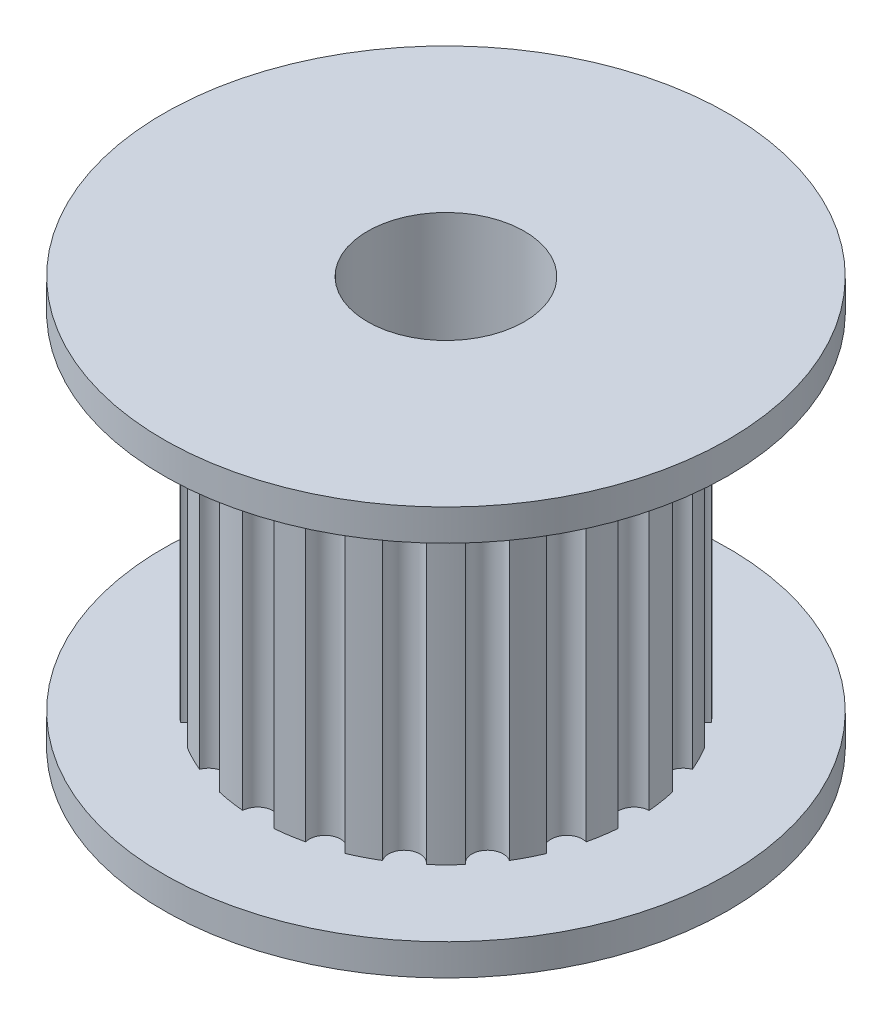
from build123d import *

# Parameters (mm, degrees)
SCHNITT_LINEAR_AUSTRAGEN1_DEPTH = 11
KREISMUSTER1_COUNT              = 20


with BuildPart() as part:
    # Skizze1 → Rotation1 (revolve)
    with BuildSketch(Plane.XY):
        Polygon((2.5, -6.5), (2.5, 6.5), (9, 6.5), (9, 5.5), (6, 5.5), (6, -5.5), (9, -5.5), (9, -6.5), align=None)
    revolve(axis=Axis((0, -6.5, 0), (0, 1, 0)))

    # Skizze2 → Schnitt-Linear austragen1 (cut)
    with BuildSketch(Plane(origin=(0, -5.5, 0), x_dir=(1, 0, 0), z_dir=(0, 1, 0))):
        with BuildLine():
            ThreePointArc((-0.499565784, 5.979166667), (0, 5.5), (0.499565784, 5.979166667))
            ThreePointArc((0.499565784, 5.979166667), (0, 6), (-0.499565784, 5.979166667))
        make_face()
    schnitt_linear_austragen1 = extrude(amount=SCHNITT_LINEAR_AUSTRAGEN1_DEPTH, mode=Mode.SUBTRACT)

    # Kreismuster1: Schnitt-Linear austragen1 ×20 about axis
    kreismuster1_axis = Axis((0, 0, 0), (0, 1, 0))
    for i in range(1, KREISMUSTER1_COUNT):
        add(schnitt_linear_austragen1.rotate(kreismuster1_axis, i * 360 / KREISMUSTER1_COUNT), mode=Mode.SUBTRACT)


solid = part.part
